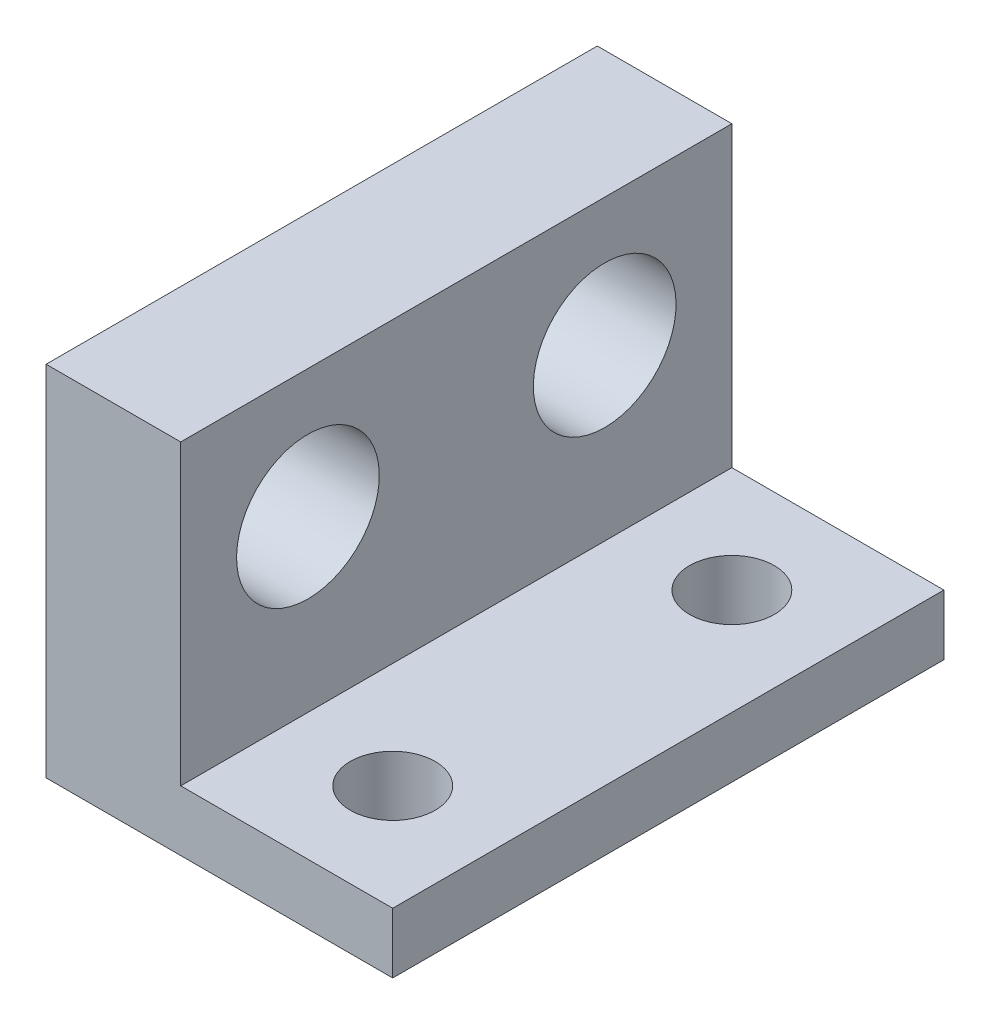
ISO-10303-21;
HEADER;
FILE_DESCRIPTION(('STEP AP214'),'2;1');
FILE_NAME('part.step','',(''),(''),'','','');
FILE_SCHEMA(('AUTOMOTIVE_DESIGN { 1 0 10303 214 1 1 1 1 }'));
ENDSEC;
DATA;
#1=APPLICATION_CONTEXT('core data for automotive mechanical design processes');
#2=APPLICATION_PROTOCOL_DEFINITION('international standard','automotive_design',2000,#1);
#3=PRODUCT_CONTEXT('',#1,'mechanical');
#4=PRODUCT('Part','Part','',(#3));
#5=PRODUCT_RELATED_PRODUCT_CATEGORY('part','',(#4));
#6=PRODUCT_DEFINITION_FORMATION('','',#4);
#7=PRODUCT_DEFINITION_CONTEXT('part definition',#1,'design');
#8=PRODUCT_DEFINITION('design','',#6,#7);
#9=PRODUCT_DEFINITION_SHAPE('','',#8);
#10=(LENGTH_UNIT() NAMED_UNIT(*) SI_UNIT(.MILLI.,.METRE.));
#11=(NAMED_UNIT(*) PLANE_ANGLE_UNIT() SI_UNIT($,.RADIAN.));
#12=(NAMED_UNIT(*) SI_UNIT($,.STERADIAN.) SOLID_ANGLE_UNIT());
#13=UNCERTAINTY_MEASURE_WITH_UNIT(LENGTH_MEASURE(1.E-05),#10,'distance_accuracy_value','');
#14=(GEOMETRIC_REPRESENTATION_CONTEXT(3) GLOBAL_UNCERTAINTY_ASSIGNED_CONTEXT((#13)) GLOBAL_UNIT_ASSIGNED_CONTEXT((#10,
#11,#12)) REPRESENTATION_CONTEXT('',''));
#15=CARTESIAN_POINT('',(0.,0.,0.));
#16=DIRECTION('',(0.,0.,1.));
#17=DIRECTION('',(1.,0.,0.));
#18=AXIS2_PLACEMENT_3D('',#15,#16,#17);
#19=CARTESIAN_POINT('',(0.,25.4,13.));
#20=DIRECTION('',(1.,0.,0.));
#21=DIRECTION('',(0.,1.,0.));
#22=AXIS2_PLACEMENT_3D('',#19,#20,#21);
#23=PLANE('',#22);
#24=CARTESIAN_POINT('',(0.,14.35,7.));
#25=DIRECTION('',(-1.,0.,0.));
#26=DIRECTION('',(0.,-1.,0.));
#27=AXIS2_PLACEMENT_3D('',#24,#25,#26);
#28=CIRCLE('',#27,3.3655);
#29=CARTESIAN_POINT('',(0.,10.9845,7.));
#30=VERTEX_POINT('',#29);
#31=EDGE_CURVE('E140',#30,#30,#28,.T.);
#32=ORIENTED_EDGE('',*,*,#31,.F.);
#33=EDGE_LOOP('',(#32));
#34=FACE_BOUND('',#33,.T.);
#35=CARTESIAN_POINT('',(0.,14.35,-7.));
#36=DIRECTION('',(-1.,0.,0.));
#37=DIRECTION('',(0.,-1.,0.));
#38=AXIS2_PLACEMENT_3D('',#35,#36,#37);
#39=CIRCLE('',#38,3.3655);
#40=CARTESIAN_POINT('',(0.,10.9845,-7.));
#41=VERTEX_POINT('',#40);
#42=EDGE_CURVE('E146',#41,#41,#39,.T.);
#43=ORIENTED_EDGE('',*,*,#42,.F.);
#44=EDGE_LOOP('',(#43));
#45=FACE_BOUND('',#44,.T.);
#46=DIRECTION('',(0.,0.,1.));
#47=VECTOR('',#46,1.);
#48=CARTESIAN_POINT('',(0.,20.4,-13.));
#49=LINE('',#48,#47);
#50=CARTESIAN_POINT('',(0.,20.4,-13.));
#51=VERTEX_POINT('',#50);
#52=CARTESIAN_POINT('',(0.,20.4,13.));
#53=VERTEX_POINT('',#52);
#54=EDGE_CURVE('E183',#51,#53,#49,.T.);
#55=ORIENTED_EDGE('',*,*,#54,.F.);
#56=DIRECTION('',(0.,-1.,0.));
#57=VECTOR('',#56,1.);
#58=CARTESIAN_POINT('',(0.,25.4,-13.));
#59=LINE('',#58,#57);
#60=CARTESIAN_POINT('',(0.,3.5,-13.));
#61=VERTEX_POINT('',#60);
#62=EDGE_CURVE('E112',#51,#61,#59,.T.);
#63=ORIENTED_EDGE('',*,*,#62,.T.);
#64=DIRECTION('',(0.,0.,-1.));
#65=VECTOR('',#64,1.);
#66=CARTESIAN_POINT('',(0.,3.5,13.));
#67=LINE('',#66,#65);
#68=CARTESIAN_POINT('',(0.,3.5,13.));
#69=VERTEX_POINT('',#68);
#70=EDGE_CURVE('E128',#69,#61,#67,.T.);
#71=ORIENTED_EDGE('',*,*,#70,.F.);
#72=DIRECTION('',(0.,-1.,0.));
#73=VECTOR('',#72,1.);
#74=CARTESIAN_POINT('',(0.,25.4,13.));
#75=LINE('',#74,#73);
#76=EDGE_CURVE('E105',#53,#69,#75,.T.);
#77=ORIENTED_EDGE('',*,*,#76,.F.);
#78=EDGE_LOOP('',(#55,#63,#71,#77));
#79=FACE_BOUND('',#78,.T.);
#80=ADVANCED_FACE('F34',(#34,#45,#79),#23,.F.);
#81=CARTESIAN_POINT('',(0.,0.,13.));
#82=DIRECTION('',(0.,0.,1.));
#83=DIRECTION('',(1.,0.,0.));
#84=AXIS2_PLACEMENT_3D('',#81,#82,#83);
#85=PLANE('',#84);
#86=DIRECTION('',(0.,1.,0.));
#87=VECTOR('',#86,1.);
#88=CARTESIAN_POINT('',(16.35,-23.65,13.));
#89=LINE('',#88,#87);
#90=CARTESIAN_POINT('',(16.35,3.5,13.));
#91=VERTEX_POINT('',#90);
#92=CARTESIAN_POINT('',(16.35,6.35,13.));
#93=VERTEX_POINT('',#92);
#94=EDGE_CURVE('E47',#91,#93,#89,.T.);
#95=ORIENTED_EDGE('',*,*,#94,.T.);
#96=DIRECTION('',(-1.,0.,0.));
#97=VECTOR('',#96,1.);
#98=CARTESIAN_POINT('',(25.4,6.34999999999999,13.));
#99=LINE('',#98,#97);
#100=CARTESIAN_POINT('',(6.35,6.35,13.));
#101=VERTEX_POINT('',#100);
#102=EDGE_CURVE('E96',#93,#101,#99,.T.);
#103=ORIENTED_EDGE('',*,*,#102,.T.);
#104=DIRECTION('',(0.,1.,0.));
#105=VECTOR('',#104,1.);
#106=CARTESIAN_POINT('',(6.35,6.35,13.));
#107=LINE('',#106,#105);
#108=CARTESIAN_POINT('',(6.35,20.4,13.));
#109=VERTEX_POINT('',#108);
#110=EDGE_CURVE('E104',#101,#109,#107,.T.);
#111=ORIENTED_EDGE('',*,*,#110,.T.);
#112=DIRECTION('',(1.,0.,0.));
#113=VECTOR('',#112,1.);
#114=CARTESIAN_POINT('',(0.,20.4,13.));
#115=LINE('',#114,#113);
#116=EDGE_CURVE('E55',#53,#109,#115,.T.);
#117=ORIENTED_EDGE('',*,*,#116,.F.);
#118=ORIENTED_EDGE('',*,*,#76,.T.);
#119=DIRECTION('',(-1.,0.,0.));
#120=VECTOR('',#119,1.);
#121=CARTESIAN_POINT('',(0.,3.5,13.));
#122=LINE('',#121,#120);
#123=EDGE_CURVE('E99',#91,#69,#122,.T.);
#124=ORIENTED_EDGE('',*,*,#123,.F.);
#125=EDGE_LOOP('',(#95,#103,#111,#117,#118,#124));
#126=FACE_BOUND('',#125,.T.);
#127=ADVANCED_FACE('F94',(#126),#85,.T.);
#128=CARTESIAN_POINT('',(0.,0.,-13.));
#129=DIRECTION('',(0.,0.,1.));
#130=DIRECTION('',(1.,0.,0.));
#131=AXIS2_PLACEMENT_3D('',#128,#129,#130);
#132=PLANE('',#131);
#133=DIRECTION('',(-1.,0.,0.));
#134=VECTOR('',#133,1.);
#135=CARTESIAN_POINT('',(25.4,6.34999999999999,-13.));
#136=LINE('',#135,#134);
#137=CARTESIAN_POINT('',(16.35,6.35,-13.));
#138=VERTEX_POINT('',#137);
#139=CARTESIAN_POINT('',(6.35,6.35,-13.));
#140=VERTEX_POINT('',#139);
#141=EDGE_CURVE('E114',#138,#140,#136,.T.);
#142=ORIENTED_EDGE('',*,*,#141,.F.);
#143=DIRECTION('',(0.,-1.,0.));
#144=VECTOR('',#143,1.);
#145=CARTESIAN_POINT('',(16.35,0.,-13.));
#146=LINE('',#145,#144);
#147=CARTESIAN_POINT('',(16.35,3.5,-13.));
#148=VERTEX_POINT('',#147);
#149=EDGE_CURVE('E86',#138,#148,#146,.T.);
#150=ORIENTED_EDGE('',*,*,#149,.T.);
#151=DIRECTION('',(1.,0.,0.));
#152=VECTOR('',#151,1.);
#153=CARTESIAN_POINT('',(0.,3.5,-13.));
#154=LINE('',#153,#152);
#155=EDGE_CURVE('E132',#61,#148,#154,.T.);
#156=ORIENTED_EDGE('',*,*,#155,.F.);
#157=ORIENTED_EDGE('',*,*,#62,.F.);
#158=DIRECTION('',(-1.,0.,0.));
#159=VECTOR('',#158,1.);
#160=CARTESIAN_POINT('',(0.,20.4,-13.));
#161=LINE('',#160,#159);
#162=CARTESIAN_POINT('',(6.35,20.4,-13.));
#163=VERTEX_POINT('',#162);
#164=EDGE_CURVE('E125',#163,#51,#161,.T.);
#165=ORIENTED_EDGE('',*,*,#164,.F.);
#166=DIRECTION('',(0.,1.,0.));
#167=VECTOR('',#166,1.);
#168=CARTESIAN_POINT('',(6.35,6.35,-13.));
#169=LINE('',#168,#167);
#170=EDGE_CURVE('E108',#140,#163,#169,.T.);
#171=ORIENTED_EDGE('',*,*,#170,.F.);
#172=EDGE_LOOP('',(#142,#150,#156,#157,#165,#171));
#173=FACE_BOUND('',#172,.T.);
#174=ADVANCED_FACE('F123',(#173),#132,.F.);
#175=CARTESIAN_POINT('',(6.35,6.35,13.));
#176=DIRECTION('',(-1.,0.,0.));
#177=DIRECTION('',(0.,0.,1.));
#178=AXIS2_PLACEMENT_3D('',#175,#176,#177);
#179=PLANE('',#178);
#180=CARTESIAN_POINT('',(6.35,14.35,-7.));
#181=DIRECTION('',(-1.,0.,0.));
#182=DIRECTION('',(0.,0.,1.));
#183=AXIS2_PLACEMENT_3D('',#180,#181,#182);
#184=CIRCLE('',#183,3.3655);
#185=CARTESIAN_POINT('',(6.35,10.9845,-7.));
#186=VERTEX_POINT('',#185);
#187=EDGE_CURVE('E115',#186,#186,#184,.F.);
#188=ORIENTED_EDGE('',*,*,#187,.F.);
#189=EDGE_LOOP('',(#188));
#190=FACE_BOUND('',#189,.T.);
#191=CARTESIAN_POINT('',(6.35,14.35,7.));
#192=DIRECTION('',(-1.,0.,0.));
#193=DIRECTION('',(0.,0.,1.));
#194=AXIS2_PLACEMENT_3D('',#191,#192,#193);
#195=CIRCLE('',#194,3.3655);
#196=CARTESIAN_POINT('',(6.35,10.9845,7.));
#197=VERTEX_POINT('',#196);
#198=EDGE_CURVE('E143',#197,#197,#195,.F.);
#199=ORIENTED_EDGE('',*,*,#198,.F.);
#200=EDGE_LOOP('',(#199));
#201=FACE_BOUND('',#200,.T.);
#202=DIRECTION('',(0.,0.,-1.));
#203=VECTOR('',#202,1.);
#204=CARTESIAN_POINT('',(6.35,20.4,-13.));
#205=LINE('',#204,#203);
#206=EDGE_CURVE('E129',#109,#163,#205,.T.);
#207=ORIENTED_EDGE('',*,*,#206,.F.);
#208=ORIENTED_EDGE('',*,*,#110,.F.);
#209=DIRECTION('',(0.,0.,-1.));
#210=VECTOR('',#209,1.);
#211=CARTESIAN_POINT('',(6.35,6.35,13.));
#212=LINE('',#211,#210);
#213=EDGE_CURVE('E41',#101,#140,#212,.T.);
#214=ORIENTED_EDGE('',*,*,#213,.T.);
#215=ORIENTED_EDGE('',*,*,#170,.T.);
#216=EDGE_LOOP('',(#207,#208,#214,#215));
#217=FACE_BOUND('',#216,.T.);
#218=ADVANCED_FACE('F120',(#190,#201,#217),#179,.F.);
#219=CARTESIAN_POINT('',(25.4,6.34999999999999,13.));
#220=DIRECTION('',(0.,-1.,0.));
#221=DIRECTION('',(1.,0.,0.));
#222=AXIS2_PLACEMENT_3D('',#219,#220,#221);
#223=PLANE('',#222);
#224=CARTESIAN_POINT('',(11.35,6.35,-8.));
#225=DIRECTION('',(0.,1.,0.));
#226=DIRECTION('',(-1.,0.,0.));
#227=AXIS2_PLACEMENT_3D('',#224,#225,#226);
#228=CIRCLE('',#227,2.);
#229=CARTESIAN_POINT('',(9.35,6.35,-8.));
#230=VERTEX_POINT('',#229);
#231=EDGE_CURVE('E191',#230,#230,#228,.T.);
#232=ORIENTED_EDGE('',*,*,#231,.F.);
#233=EDGE_LOOP('',(#232));
#234=FACE_BOUND('',#233,.T.);
#235=CARTESIAN_POINT('',(11.35,6.35,8.));
#236=DIRECTION('',(0.,1.,0.));
#237=DIRECTION('',(-1.,0.,0.));
#238=AXIS2_PLACEMENT_3D('',#235,#236,#237);
#239=CIRCLE('',#238,2.);
#240=CARTESIAN_POINT('',(9.35,6.35,8.));
#241=VERTEX_POINT('',#240);
#242=EDGE_CURVE('E90',#241,#241,#239,.T.);
#243=ORIENTED_EDGE('',*,*,#242,.F.);
#244=EDGE_LOOP('',(#243));
#245=FACE_BOUND('',#244,.T.);
#246=ORIENTED_EDGE('',*,*,#102,.F.);
#247=DIRECTION('',(0.,0.,1.));
#248=VECTOR('',#247,1.);
#249=CARTESIAN_POINT('',(16.35,6.35,-44.5));
#250=LINE('',#249,#248);
#251=EDGE_CURVE('E83',#138,#93,#250,.T.);
#252=ORIENTED_EDGE('',*,*,#251,.F.);
#253=ORIENTED_EDGE('',*,*,#141,.T.);
#254=ORIENTED_EDGE('',*,*,#213,.F.);
#255=EDGE_LOOP('',(#246,#252,#253,#254));
#256=FACE_BOUND('',#255,.T.);
#257=ADVANCED_FACE('F101',(#234,#245,#256),#223,.F.);
#258=CARTESIAN_POINT('',(25.401,14.35,-7.));
#259=DIRECTION('',(-1.,0.,0.));
#260=DIRECTION('',(0.,-1.,0.));
#261=AXIS2_PLACEMENT_3D('',#258,#259,#260);
#262=CYLINDRICAL_SURFACE('',#261,3.3655);
#263=CARTESIAN_POINT('',(0.,10.9845,-7.));
#264=CARTESIAN_POINT('',(0.0661458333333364,10.9845,-7.));
#265=CARTESIAN_POINT('',(0.132291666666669,10.9845,-7.));
#266=CARTESIAN_POINT('',(0.264583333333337,10.9845,-7.));
#267=CARTESIAN_POINT('',(0.330729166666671,10.9845,-7.));
#268=CARTESIAN_POINT('',(0.463020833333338,10.9845,-7.));
#269=CARTESIAN_POINT('',(0.529166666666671,10.9845,-7.));
#270=CARTESIAN_POINT('',(0.661458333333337,10.9845,-7.));
#271=CARTESIAN_POINT('',(0.72760416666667,10.9845,-7.));
#272=CARTESIAN_POINT('',(0.859895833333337,10.9845,-7.));
#273=CARTESIAN_POINT('',(0.926041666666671,10.9845,-7.));
#274=CARTESIAN_POINT('',(1.05833333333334,10.9845,-7.));
#275=CARTESIAN_POINT('',(1.12447916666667,10.9845,-7.));
#276=CARTESIAN_POINT('',(1.25677083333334,10.9845,-7.));
#277=CARTESIAN_POINT('',(1.32291666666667,10.9845,-7.));
#278=CARTESIAN_POINT('',(1.45520833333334,10.9845,-7.));
#279=CARTESIAN_POINT('',(1.52135416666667,10.9845,-7.));
#280=CARTESIAN_POINT('',(1.65364583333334,10.9845,-7.));
#281=CARTESIAN_POINT('',(1.71979166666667,10.9845,-7.));
#282=CARTESIAN_POINT('',(1.85208333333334,10.9845,-7.));
#283=CARTESIAN_POINT('',(1.91822916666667,10.9845,-7.));
#284=CARTESIAN_POINT('',(2.05052083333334,10.9845,-7.));
#285=CARTESIAN_POINT('',(2.11666666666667,10.9845,-7.));
#286=CARTESIAN_POINT('',(2.24895833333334,10.9845,-7.));
#287=CARTESIAN_POINT('',(2.31510416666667,10.9845,-7.));
#288=CARTESIAN_POINT('',(2.44739583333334,10.9845,-7.));
#289=CARTESIAN_POINT('',(2.51354166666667,10.9845,-7.));
#290=CARTESIAN_POINT('',(2.64583333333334,10.9845,-7.));
#291=CARTESIAN_POINT('',(2.71197916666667,10.9845,-7.));
#292=CARTESIAN_POINT('',(2.84427083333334,10.9845,-7.));
#293=CARTESIAN_POINT('',(2.91041666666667,10.9845,-7.));
#294=CARTESIAN_POINT('',(3.04270833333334,10.9845,-7.));
#295=CARTESIAN_POINT('',(3.10885416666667,10.9845,-7.));
#296=CARTESIAN_POINT('',(3.24114583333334,10.9845,-7.));
#297=CARTESIAN_POINT('',(3.30729166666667,10.9845,-7.));
#298=CARTESIAN_POINT('',(3.43958333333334,10.9845,-7.));
#299=CARTESIAN_POINT('',(3.50572916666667,10.9845,-7.));
#300=CARTESIAN_POINT('',(3.63802083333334,10.9845,-7.));
#301=CARTESIAN_POINT('',(3.70416666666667,10.9845,-7.));
#302=CARTESIAN_POINT('',(3.83645833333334,10.9845,-7.));
#303=CARTESIAN_POINT('',(3.90260416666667,10.9845,-7.));
#304=CARTESIAN_POINT('',(4.03489583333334,10.9845,-7.));
#305=CARTESIAN_POINT('',(4.10104166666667,10.9845,-7.));
#306=CARTESIAN_POINT('',(4.23333333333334,10.9845,-7.));
#307=CARTESIAN_POINT('',(4.29947916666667,10.9845,-7.));
#308=CARTESIAN_POINT('',(4.43177083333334,10.9845,-7.));
#309=CARTESIAN_POINT('',(4.49791666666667,10.9845,-7.));
#310=CARTESIAN_POINT('',(4.63020833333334,10.9845,-7.));
#311=CARTESIAN_POINT('',(4.69635416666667,10.9845,-7.));
#312=CARTESIAN_POINT('',(4.82864583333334,10.9845,-7.));
#313=CARTESIAN_POINT('',(4.89479166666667,10.9845,-7.));
#314=CARTESIAN_POINT('',(5.02708333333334,10.9845,-7.));
#315=CARTESIAN_POINT('',(5.09322916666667,10.9845,-7.));
#316=CARTESIAN_POINT('',(5.22552083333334,10.9845,-7.));
#317=CARTESIAN_POINT('',(5.29166666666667,10.9845,-7.));
#318=CARTESIAN_POINT('',(5.42395833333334,10.9845,-7.));
#319=CARTESIAN_POINT('',(5.49010416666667,10.9845,-7.));
#320=CARTESIAN_POINT('',(5.62239583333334,10.9845,-7.));
#321=CARTESIAN_POINT('',(5.68854166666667,10.9845,-7.));
#322=CARTESIAN_POINT('',(5.82083333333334,10.9845,-7.));
#323=CARTESIAN_POINT('',(5.88697916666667,10.9845,-7.));
#324=CARTESIAN_POINT('',(6.01927083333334,10.9845,-7.));
#325=CARTESIAN_POINT('',(6.08541666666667,10.9845,-7.));
#326=CARTESIAN_POINT('',(6.21770833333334,10.9845,-7.));
#327=CARTESIAN_POINT('',(6.28385416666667,10.9845,-7.));
#328=CARTESIAN_POINT('',(6.35,10.9845,-7.));
#329=B_SPLINE_CURVE_WITH_KNOTS('',3,(#263,#264,#265,#266,#267,#268,#269,#270,#271,#272,#273,
#274,#275,#276,#277,#278,#279,#280,#281,#282,#283,#284,#285,#286,#287,#288,#289,#290,#291,#292,
#293,#294,#295,#296,#297,#298,#299,#300,#301,#302,#303,#304,#305,#306,#307,#308,#309,#310,#311,
#312,#313,#314,#315,#316,#317,#318,#319,#320,#321,#322,#323,#324,#325,#326,#327,#328),
.UNSPECIFIED.,.F.,.F.,(4,2,2,2,2,2,2,2,2,2,2,2,2,2,2,2,2,2,2,2,2,2,2,2,2,2,2,2,2,2,2,2,4),(0.,
0.198437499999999,0.396875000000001,0.5953125,0.793749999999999,0.992187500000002,1.190625,
1.3890625,1.5875,1.7859375,1.984375,2.1828125,2.38125,2.5796875,2.778125,2.9765625,3.175,
3.3734375,3.571875,3.7703125,3.96875,4.1671875,4.365625,4.5640625,4.7625,4.9609375,5.159375,
5.3578125,5.55625,5.7546875,5.953125,6.1515625,6.35),.UNSPECIFIED.);
#330=EDGE_CURVE('BSEAM151',#41,#186,#329,.T.);
#331=ORIENTED_EDGE('',*,*,#42,.T.);
#332=ORIENTED_EDGE('',*,*,#187,.T.);
#333=ORIENTED_EDGE('',*,*,#330,.T.);
#334=ORIENTED_EDGE('',*,*,#330,.F.);
#335=EDGE_LOOP('',(#331,#333,#332,#334));
#336=FACE_BOUND('',#335,.T.);
#337=ADVANCED_FACE('F151',(#336),#262,.F.);
#338=CARTESIAN_POINT('',(25.401,14.35,7.));
#339=DIRECTION('',(-1.,0.,0.));
#340=DIRECTION('',(0.,-1.,0.));
#341=AXIS2_PLACEMENT_3D('',#338,#339,#340);
#342=CYLINDRICAL_SURFACE('',#341,3.3655);
#343=CARTESIAN_POINT('',(0.,10.9845,7.));
#344=CARTESIAN_POINT('',(0.0661458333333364,10.9845,7.));
#345=CARTESIAN_POINT('',(0.132291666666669,10.9845,7.));
#346=CARTESIAN_POINT('',(0.264583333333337,10.9845,7.));
#347=CARTESIAN_POINT('',(0.330729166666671,10.9845,7.));
#348=CARTESIAN_POINT('',(0.463020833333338,10.9845,7.));
#349=CARTESIAN_POINT('',(0.529166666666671,10.9845,7.));
#350=CARTESIAN_POINT('',(0.661458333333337,10.9845,7.));
#351=CARTESIAN_POINT('',(0.72760416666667,10.9845,7.));
#352=CARTESIAN_POINT('',(0.859895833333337,10.9845,7.));
#353=CARTESIAN_POINT('',(0.926041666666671,10.9845,7.));
#354=CARTESIAN_POINT('',(1.05833333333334,10.9845,7.));
#355=CARTESIAN_POINT('',(1.12447916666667,10.9845,7.));
#356=CARTESIAN_POINT('',(1.25677083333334,10.9845,7.));
#357=CARTESIAN_POINT('',(1.32291666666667,10.9845,7.));
#358=CARTESIAN_POINT('',(1.45520833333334,10.9845,7.));
#359=CARTESIAN_POINT('',(1.52135416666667,10.9845,7.));
#360=CARTESIAN_POINT('',(1.65364583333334,10.9845,7.));
#361=CARTESIAN_POINT('',(1.71979166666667,10.9845,7.));
#362=CARTESIAN_POINT('',(1.85208333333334,10.9845,7.));
#363=CARTESIAN_POINT('',(1.91822916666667,10.9845,7.));
#364=CARTESIAN_POINT('',(2.05052083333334,10.9845,7.));
#365=CARTESIAN_POINT('',(2.11666666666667,10.9845,7.));
#366=CARTESIAN_POINT('',(2.24895833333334,10.9845,7.));
#367=CARTESIAN_POINT('',(2.31510416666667,10.9845,7.));
#368=CARTESIAN_POINT('',(2.44739583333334,10.9845,7.));
#369=CARTESIAN_POINT('',(2.51354166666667,10.9845,7.));
#370=CARTESIAN_POINT('',(2.64583333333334,10.9845,7.));
#371=CARTESIAN_POINT('',(2.71197916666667,10.9845,7.));
#372=CARTESIAN_POINT('',(2.84427083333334,10.9845,7.));
#373=CARTESIAN_POINT('',(2.91041666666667,10.9845,7.));
#374=CARTESIAN_POINT('',(3.04270833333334,10.9845,7.));
#375=CARTESIAN_POINT('',(3.10885416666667,10.9845,7.));
#376=CARTESIAN_POINT('',(3.24114583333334,10.9845,7.));
#377=CARTESIAN_POINT('',(3.30729166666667,10.9845,7.));
#378=CARTESIAN_POINT('',(3.43958333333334,10.9845,7.));
#379=CARTESIAN_POINT('',(3.50572916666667,10.9845,7.));
#380=CARTESIAN_POINT('',(3.63802083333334,10.9845,7.));
#381=CARTESIAN_POINT('',(3.70416666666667,10.9845,7.));
#382=CARTESIAN_POINT('',(3.83645833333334,10.9845,7.));
#383=CARTESIAN_POINT('',(3.90260416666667,10.9845,7.));
#384=CARTESIAN_POINT('',(4.03489583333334,10.9845,7.));
#385=CARTESIAN_POINT('',(4.10104166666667,10.9845,7.));
#386=CARTESIAN_POINT('',(4.23333333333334,10.9845,7.));
#387=CARTESIAN_POINT('',(4.29947916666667,10.9845,7.));
#388=CARTESIAN_POINT('',(4.43177083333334,10.9845,7.));
#389=CARTESIAN_POINT('',(4.49791666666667,10.9845,7.));
#390=CARTESIAN_POINT('',(4.63020833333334,10.9845,7.));
#391=CARTESIAN_POINT('',(4.69635416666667,10.9845,7.));
#392=CARTESIAN_POINT('',(4.82864583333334,10.9845,7.));
#393=CARTESIAN_POINT('',(4.89479166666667,10.9845,7.));
#394=CARTESIAN_POINT('',(5.02708333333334,10.9845,7.));
#395=CARTESIAN_POINT('',(5.09322916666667,10.9845,7.));
#396=CARTESIAN_POINT('',(5.22552083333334,10.9845,7.));
#397=CARTESIAN_POINT('',(5.29166666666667,10.9845,7.));
#398=CARTESIAN_POINT('',(5.42395833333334,10.9845,7.));
#399=CARTESIAN_POINT('',(5.49010416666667,10.9845,7.));
#400=CARTESIAN_POINT('',(5.62239583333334,10.9845,7.));
#401=CARTESIAN_POINT('',(5.68854166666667,10.9845,7.));
#402=CARTESIAN_POINT('',(5.82083333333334,10.9845,7.));
#403=CARTESIAN_POINT('',(5.88697916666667,10.9845,7.));
#404=CARTESIAN_POINT('',(6.01927083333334,10.9845,7.));
#405=CARTESIAN_POINT('',(6.08541666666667,10.9845,7.));
#406=CARTESIAN_POINT('',(6.21770833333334,10.9845,7.));
#407=CARTESIAN_POINT('',(6.28385416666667,10.9845,7.));
#408=CARTESIAN_POINT('',(6.35,10.9845,7.));
#409=B_SPLINE_CURVE_WITH_KNOTS('',3,(#343,#344,#345,#346,#347,#348,#349,#350,#351,#352,#353,
#354,#355,#356,#357,#358,#359,#360,#361,#362,#363,#364,#365,#366,#367,#368,#369,#370,#371,#372,
#373,#374,#375,#376,#377,#378,#379,#380,#381,#382,#383,#384,#385,#386,#387,#388,#389,#390,#391,
#392,#393,#394,#395,#396,#397,#398,#399,#400,#401,#402,#403,#404,#405,#406,#407,#408),
.UNSPECIFIED.,.F.,.F.,(4,2,2,2,2,2,2,2,2,2,2,2,2,2,2,2,2,2,2,2,2,2,2,2,2,2,2,2,2,2,2,2,4),(0.,
0.198437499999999,0.396875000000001,0.5953125,0.793749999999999,0.992187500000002,1.190625,
1.3890625,1.5875,1.7859375,1.984375,2.1828125,2.38125,2.5796875,2.778125,2.9765625,3.175,
3.3734375,3.571875,3.7703125,3.96875,4.1671875,4.365625,4.5640625,4.7625,4.9609375,5.159375,
5.3578125,5.55625,5.7546875,5.953125,6.1515625,6.35),.UNSPECIFIED.);
#410=EDGE_CURVE('BSEAM158',#30,#197,#409,.T.);
#411=ORIENTED_EDGE('',*,*,#31,.T.);
#412=ORIENTED_EDGE('',*,*,#198,.T.);
#413=ORIENTED_EDGE('',*,*,#410,.T.);
#414=ORIENTED_EDGE('',*,*,#410,.F.);
#415=EDGE_LOOP('',(#411,#413,#412,#414));
#416=FACE_BOUND('',#415,.T.);
#417=ADVANCED_FACE('F158',(#416),#342,.F.);
#418=CARTESIAN_POINT('',(0.,3.5,0.));
#419=DIRECTION('',(0.,-1.,0.));
#420=DIRECTION('',(0.,0.,-1.));
#421=AXIS2_PLACEMENT_3D('',#418,#419,#420);
#422=PLANE('',#421);
#423=CARTESIAN_POINT('',(11.35,3.5,-8.));
#424=DIRECTION('',(0.,-1.,0.));
#425=DIRECTION('',(0.,0.,-1.));
#426=AXIS2_PLACEMENT_3D('',#423,#424,#425);
#427=CIRCLE('',#426,2.);
#428=CARTESIAN_POINT('',(9.35,3.5,-8.));
#429=VERTEX_POINT('',#428);
#430=EDGE_CURVE('E194',#429,#429,#427,.F.);
#431=ORIENTED_EDGE('',*,*,#430,.T.);
#432=EDGE_LOOP('',(#431));
#433=FACE_BOUND('',#432,.T.);
#434=CARTESIAN_POINT('',(11.35,3.5,8.));
#435=DIRECTION('',(0.,-1.,0.));
#436=DIRECTION('',(0.,0.,-1.));
#437=AXIS2_PLACEMENT_3D('',#434,#435,#436);
#438=CIRCLE('',#437,2.);
#439=CARTESIAN_POINT('',(9.35,3.5,8.));
#440=VERTEX_POINT('',#439);
#441=EDGE_CURVE('E188',#440,#440,#438,.F.);
#442=ORIENTED_EDGE('',*,*,#441,.T.);
#443=EDGE_LOOP('',(#442));
#444=FACE_BOUND('',#443,.T.);
#445=DIRECTION('',(0.,0.,-1.));
#446=VECTOR('',#445,1.);
#447=CARTESIAN_POINT('',(16.35,3.5,0.));
#448=LINE('',#447,#446);
#449=EDGE_CURVE('E11',#91,#148,#448,.T.);
#450=ORIENTED_EDGE('',*,*,#449,.F.);
#451=ORIENTED_EDGE('',*,*,#123,.T.);
#452=ORIENTED_EDGE('',*,*,#70,.T.);
#453=ORIENTED_EDGE('',*,*,#155,.T.);
#454=EDGE_LOOP('',(#450,#451,#452,#453));
#455=FACE_BOUND('',#454,.T.);
#456=ADVANCED_FACE('F160',(#433,#444,#455),#422,.T.);
#457=CARTESIAN_POINT('',(0.,20.4,0.));
#458=DIRECTION('',(0.,1.,0.));
#459=DIRECTION('',(0.,0.,1.));
#460=AXIS2_PLACEMENT_3D('',#457,#458,#459);
#461=PLANE('',#460);
#462=ORIENTED_EDGE('',*,*,#54,.T.);
#463=ORIENTED_EDGE('',*,*,#116,.T.);
#464=ORIENTED_EDGE('',*,*,#206,.T.);
#465=ORIENTED_EDGE('',*,*,#164,.T.);
#466=EDGE_LOOP('',(#462,#463,#464,#465));
#467=FACE_BOUND('',#466,.T.);
#468=ADVANCED_FACE('F167',(#467),#461,.T.);
#469=CARTESIAN_POINT('',(16.35,-23.65,-44.5));
#470=DIRECTION('',(-1.,0.,0.));
#471=DIRECTION('',(0.,-1.,0.));
#472=AXIS2_PLACEMENT_3D('',#469,#470,#471);
#473=PLANE('',#472);
#474=ORIENTED_EDGE('',*,*,#251,.T.);
#475=ORIENTED_EDGE('',*,*,#94,.F.);
#476=ORIENTED_EDGE('',*,*,#449,.T.);
#477=ORIENTED_EDGE('',*,*,#149,.F.);
#478=EDGE_LOOP('',(#474,#475,#476,#477));
#479=FACE_BOUND('',#478,.T.);
#480=ADVANCED_FACE('F84',(#479),#473,.F.);
#481=CARTESIAN_POINT('',(11.35,3.499,8.));
#482=DIRECTION('',(0.,1.,0.));
#483=DIRECTION('',(-1.,0.,0.));
#484=AXIS2_PLACEMENT_3D('',#481,#482,#483);
#485=CYLINDRICAL_SURFACE('',#484,2.);
#486=CARTESIAN_POINT('',(9.35,3.5,8.));
#487=CARTESIAN_POINT('',(9.35,3.5296875,8.));
#488=CARTESIAN_POINT('',(9.35,3.559375,8.));
#489=CARTESIAN_POINT('',(9.35,3.61875,8.));
#490=CARTESIAN_POINT('',(9.35,3.6484375,8.));
#491=CARTESIAN_POINT('',(9.35,3.7078125,8.));
#492=CARTESIAN_POINT('',(9.35,3.7375,8.));
#493=CARTESIAN_POINT('',(9.35,3.796875,8.));
#494=CARTESIAN_POINT('',(9.35,3.8265625,8.));
#495=CARTESIAN_POINT('',(9.35,3.8859375,8.));
#496=CARTESIAN_POINT('',(9.35,3.915625,8.));
#497=CARTESIAN_POINT('',(9.35,3.975,8.));
#498=CARTESIAN_POINT('',(9.35,4.0046875,8.));
#499=CARTESIAN_POINT('',(9.35,4.0640625,8.));
#500=CARTESIAN_POINT('',(9.35,4.09375,8.));
#501=CARTESIAN_POINT('',(9.35,4.153125,8.));
#502=CARTESIAN_POINT('',(9.35,4.1828125,8.));
#503=CARTESIAN_POINT('',(9.35,4.2421875,8.));
#504=CARTESIAN_POINT('',(9.35,4.271875,8.));
#505=CARTESIAN_POINT('',(9.35,4.33125,8.));
#506=CARTESIAN_POINT('',(9.35,4.3609375,8.));
#507=CARTESIAN_POINT('',(9.35,4.4203125,8.));
#508=CARTESIAN_POINT('',(9.35,4.45,8.));
#509=CARTESIAN_POINT('',(9.35,4.509375,8.));
#510=CARTESIAN_POINT('',(9.35,4.5390625,8.));
#511=CARTESIAN_POINT('',(9.35,4.5984375,8.));
#512=CARTESIAN_POINT('',(9.35,4.628125,8.));
#513=CARTESIAN_POINT('',(9.35,4.6875,8.));
#514=CARTESIAN_POINT('',(9.35,4.7171875,8.));
#515=CARTESIAN_POINT('',(9.35,4.7765625,8.));
#516=CARTESIAN_POINT('',(9.35,4.80625,8.));
#517=CARTESIAN_POINT('',(9.35,4.865625,8.));
#518=CARTESIAN_POINT('',(9.35,4.8953125,8.));
#519=CARTESIAN_POINT('',(9.35,4.9546875,8.));
#520=CARTESIAN_POINT('',(9.35,4.984375,8.));
#521=CARTESIAN_POINT('',(9.35,5.04375,8.));
#522=CARTESIAN_POINT('',(9.35,5.0734375,8.));
#523=CARTESIAN_POINT('',(9.35,5.1328125,8.));
#524=CARTESIAN_POINT('',(9.35,5.1625,8.));
#525=CARTESIAN_POINT('',(9.35,5.221875,8.));
#526=CARTESIAN_POINT('',(9.35,5.2515625,8.));
#527=CARTESIAN_POINT('',(9.35,5.3109375,8.));
#528=CARTESIAN_POINT('',(9.35,5.340625,8.));
#529=CARTESIAN_POINT('',(9.35,5.4,8.));
#530=CARTESIAN_POINT('',(9.35,5.4296875,8.));
#531=CARTESIAN_POINT('',(9.35,5.4890625,8.));
#532=CARTESIAN_POINT('',(9.35,5.51875,8.));
#533=CARTESIAN_POINT('',(9.35,5.578125,8.));
#534=CARTESIAN_POINT('',(9.35,5.6078125,8.));
#535=CARTESIAN_POINT('',(9.35,5.6671875,8.));
#536=CARTESIAN_POINT('',(9.35,5.696875,8.));
#537=CARTESIAN_POINT('',(9.35,5.75625,8.));
#538=CARTESIAN_POINT('',(9.35,5.7859375,8.));
#539=CARTESIAN_POINT('',(9.35,5.8453125,8.));
#540=CARTESIAN_POINT('',(9.35,5.875,8.));
#541=CARTESIAN_POINT('',(9.35,5.934375,8.));
#542=CARTESIAN_POINT('',(9.35,5.9640625,8.));
#543=CARTESIAN_POINT('',(9.35,6.0234375,8.));
#544=CARTESIAN_POINT('',(9.35,6.053125,8.));
#545=CARTESIAN_POINT('',(9.35,6.1125,8.));
#546=CARTESIAN_POINT('',(9.35,6.1421875,8.));
#547=CARTESIAN_POINT('',(9.35,6.2015625,8.));
#548=CARTESIAN_POINT('',(9.35,6.23125,8.));
#549=CARTESIAN_POINT('',(9.35,6.290625,8.));
#550=CARTESIAN_POINT('',(9.35,6.3203125,8.));
#551=CARTESIAN_POINT('',(9.35,6.35,8.));
#552=B_SPLINE_CURVE_WITH_KNOTS('',3,(#486,#487,#488,#489,#490,#491,#492,#493,#494,#495,#496,
#497,#498,#499,#500,#501,#502,#503,#504,#505,#506,#507,#508,#509,#510,#511,#512,#513,#514,#515,
#516,#517,#518,#519,#520,#521,#522,#523,#524,#525,#526,#527,#528,#529,#530,#531,#532,#533,#534,
#535,#536,#537,#538,#539,#540,#541,#542,#543,#544,#545,#546,#547,#548,#549,#550,#551),
.UNSPECIFIED.,.F.,.F.,(4,2,2,2,2,2,2,2,2,2,2,2,2,2,2,2,2,2,2,2,2,2,2,2,2,2,2,2,2,2,2,2,4),(0.,
0.0890625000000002,0.178125,0.2671875,0.35625,0.4453125,0.534375,0.623437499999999,
0.712499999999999,0.801562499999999,0.890624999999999,0.979687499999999,1.06875,1.1578125,
1.246875,1.3359375,1.425,1.5140625,1.603125,1.6921875,1.78125,1.8703125,1.959375,2.0484375,
2.1375,2.2265625,2.315625,2.4046875,2.49375,2.5828125,2.671875,2.7609375,2.85),.UNSPECIFIED.);
#553=EDGE_CURVE('BSEAM206',#440,#241,#552,.T.);
#554=ORIENTED_EDGE('',*,*,#441,.F.);
#555=ORIENTED_EDGE('',*,*,#242,.T.);
#556=ORIENTED_EDGE('',*,*,#553,.T.);
#557=ORIENTED_EDGE('',*,*,#553,.F.);
#558=EDGE_LOOP('',(#554,#556,#555,#557));
#559=FACE_BOUND('',#558,.T.);
#560=ADVANCED_FACE('F206',(#559),#485,.F.);
#561=CARTESIAN_POINT('',(11.35,3.499,-8.));
#562=DIRECTION('',(0.,1.,0.));
#563=DIRECTION('',(-1.,0.,0.));
#564=AXIS2_PLACEMENT_3D('',#561,#562,#563);
#565=CYLINDRICAL_SURFACE('',#564,2.);
#566=CARTESIAN_POINT('',(9.35,3.5,-8.));
#567=CARTESIAN_POINT('',(9.35,3.5296875,-8.));
#568=CARTESIAN_POINT('',(9.35,3.559375,-8.));
#569=CARTESIAN_POINT('',(9.35,3.61875,-8.));
#570=CARTESIAN_POINT('',(9.35,3.6484375,-8.));
#571=CARTESIAN_POINT('',(9.35,3.7078125,-8.));
#572=CARTESIAN_POINT('',(9.35,3.7375,-8.));
#573=CARTESIAN_POINT('',(9.35,3.796875,-8.));
#574=CARTESIAN_POINT('',(9.35,3.8265625,-8.));
#575=CARTESIAN_POINT('',(9.35,3.8859375,-8.));
#576=CARTESIAN_POINT('',(9.35,3.915625,-8.));
#577=CARTESIAN_POINT('',(9.35,3.975,-8.));
#578=CARTESIAN_POINT('',(9.35,4.0046875,-8.));
#579=CARTESIAN_POINT('',(9.35,4.0640625,-8.));
#580=CARTESIAN_POINT('',(9.35,4.09375,-8.));
#581=CARTESIAN_POINT('',(9.35,4.153125,-8.));
#582=CARTESIAN_POINT('',(9.35,4.1828125,-8.));
#583=CARTESIAN_POINT('',(9.35,4.2421875,-8.));
#584=CARTESIAN_POINT('',(9.35,4.271875,-8.));
#585=CARTESIAN_POINT('',(9.35,4.33125,-8.));
#586=CARTESIAN_POINT('',(9.35,4.3609375,-8.));
#587=CARTESIAN_POINT('',(9.35,4.4203125,-8.));
#588=CARTESIAN_POINT('',(9.35,4.45,-8.));
#589=CARTESIAN_POINT('',(9.35,4.509375,-8.));
#590=CARTESIAN_POINT('',(9.35,4.5390625,-8.));
#591=CARTESIAN_POINT('',(9.35,4.5984375,-8.));
#592=CARTESIAN_POINT('',(9.35,4.628125,-8.));
#593=CARTESIAN_POINT('',(9.35,4.6875,-8.));
#594=CARTESIAN_POINT('',(9.35,4.7171875,-8.));
#595=CARTESIAN_POINT('',(9.35,4.7765625,-8.));
#596=CARTESIAN_POINT('',(9.35,4.80625,-8.));
#597=CARTESIAN_POINT('',(9.35,4.865625,-8.));
#598=CARTESIAN_POINT('',(9.35,4.8953125,-8.));
#599=CARTESIAN_POINT('',(9.35,4.9546875,-8.));
#600=CARTESIAN_POINT('',(9.35,4.984375,-8.));
#601=CARTESIAN_POINT('',(9.35,5.04375,-8.));
#602=CARTESIAN_POINT('',(9.35,5.0734375,-8.));
#603=CARTESIAN_POINT('',(9.35,5.1328125,-8.));
#604=CARTESIAN_POINT('',(9.35,5.1625,-8.));
#605=CARTESIAN_POINT('',(9.35,5.221875,-8.));
#606=CARTESIAN_POINT('',(9.35,5.2515625,-8.));
#607=CARTESIAN_POINT('',(9.35,5.3109375,-8.));
#608=CARTESIAN_POINT('',(9.35,5.340625,-8.));
#609=CARTESIAN_POINT('',(9.35,5.4,-8.));
#610=CARTESIAN_POINT('',(9.35,5.4296875,-8.));
#611=CARTESIAN_POINT('',(9.35,5.4890625,-8.));
#612=CARTESIAN_POINT('',(9.35,5.51875,-8.));
#613=CARTESIAN_POINT('',(9.35,5.578125,-8.));
#614=CARTESIAN_POINT('',(9.35,5.6078125,-8.));
#615=CARTESIAN_POINT('',(9.35,5.6671875,-8.));
#616=CARTESIAN_POINT('',(9.35,5.696875,-8.));
#617=CARTESIAN_POINT('',(9.35,5.75625,-8.));
#618=CARTESIAN_POINT('',(9.35,5.7859375,-8.));
#619=CARTESIAN_POINT('',(9.35,5.8453125,-8.));
#620=CARTESIAN_POINT('',(9.35,5.875,-8.));
#621=CARTESIAN_POINT('',(9.35,5.934375,-8.));
#622=CARTESIAN_POINT('',(9.35,5.9640625,-8.));
#623=CARTESIAN_POINT('',(9.35,6.0234375,-8.));
#624=CARTESIAN_POINT('',(9.35,6.053125,-8.));
#625=CARTESIAN_POINT('',(9.35,6.1125,-8.));
#626=CARTESIAN_POINT('',(9.35,6.1421875,-8.));
#627=CARTESIAN_POINT('',(9.35,6.2015625,-8.));
#628=CARTESIAN_POINT('',(9.35,6.23125,-8.));
#629=CARTESIAN_POINT('',(9.35,6.290625,-8.));
#630=CARTESIAN_POINT('',(9.35,6.3203125,-8.));
#631=CARTESIAN_POINT('',(9.35,6.35,-8.));
#632=B_SPLINE_CURVE_WITH_KNOTS('',3,(#566,#567,#568,#569,#570,#571,#572,#573,#574,#575,#576,
#577,#578,#579,#580,#581,#582,#583,#584,#585,#586,#587,#588,#589,#590,#591,#592,#593,#594,#595,
#596,#597,#598,#599,#600,#601,#602,#603,#604,#605,#606,#607,#608,#609,#610,#611,#612,#613,#614,
#615,#616,#617,#618,#619,#620,#621,#622,#623,#624,#625,#626,#627,#628,#629,#630,#631),
.UNSPECIFIED.,.F.,.F.,(4,2,2,2,2,2,2,2,2,2,2,2,2,2,2,2,2,2,2,2,2,2,2,2,2,2,2,2,2,2,2,2,4),(0.,
0.0890625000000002,0.178125,0.2671875,0.35625,0.4453125,0.534375,0.623437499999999,
0.712499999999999,0.801562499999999,0.890624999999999,0.979687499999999,1.06875,1.1578125,
1.246875,1.3359375,1.425,1.5140625,1.603125,1.6921875,1.78125,1.8703125,1.959375,2.0484375,
2.1375,2.2265625,2.315625,2.4046875,2.49375,2.5828125,2.671875,2.7609375,2.85),.UNSPECIFIED.);
#633=EDGE_CURVE('BSEAM200',#429,#230,#632,.T.);
#634=ORIENTED_EDGE('',*,*,#430,.F.);
#635=ORIENTED_EDGE('',*,*,#231,.T.);
#636=ORIENTED_EDGE('',*,*,#633,.T.);
#637=ORIENTED_EDGE('',*,*,#633,.F.);
#638=EDGE_LOOP('',(#634,#636,#635,#637));
#639=FACE_BOUND('',#638,.T.);
#640=ADVANCED_FACE('F200',(#639),#565,.F.);
#641=CLOSED_SHELL('',(#80,#127,#174,#218,#257,#337,#417,#456,#468,#480,#560,#640));
#642=MANIFOLD_SOLID_BREP('B2',#641);
#643=ADVANCED_BREP_SHAPE_REPRESENTATION('',(#18,#642),#14);
#644=SHAPE_DEFINITION_REPRESENTATION(#9,#643);
ENDSEC;
END-ISO-10303-21;
